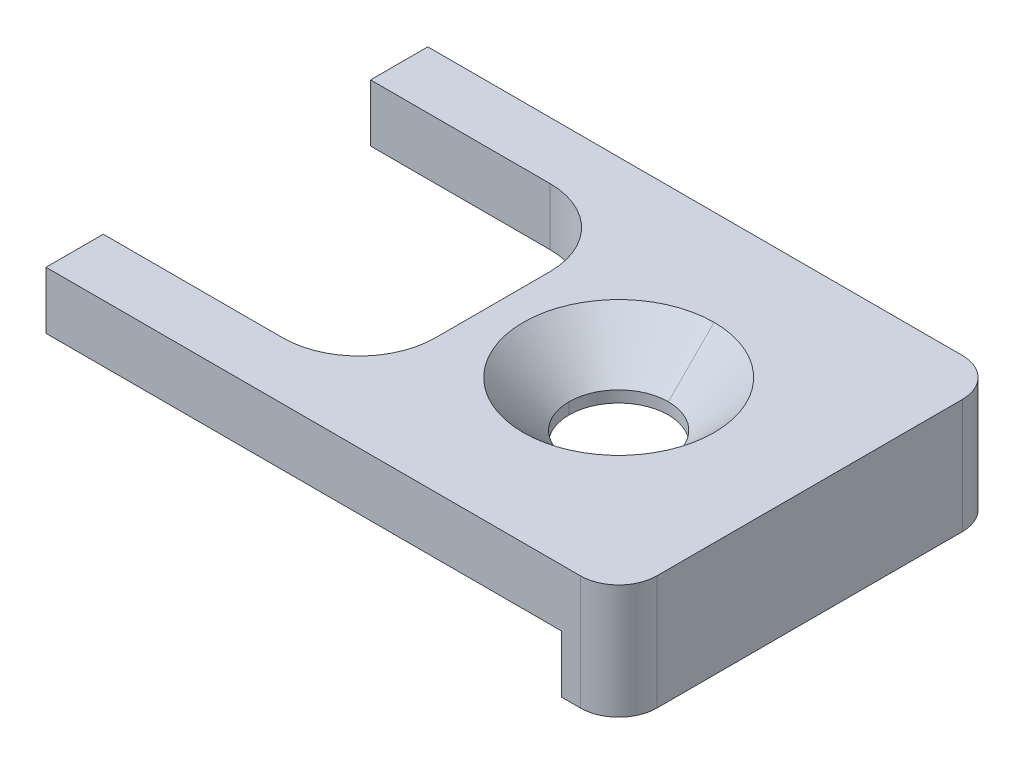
ISO-10303-21;
HEADER;
FILE_DESCRIPTION(('STEP AP214'),'2;1');
FILE_NAME('part.step','',(''),(''),'','','');
FILE_SCHEMA(('AUTOMOTIVE_DESIGN { 1 0 10303 214 1 1 1 1 }'));
ENDSEC;
DATA;
#1=APPLICATION_CONTEXT('core data for automotive mechanical design processes');
#2=APPLICATION_PROTOCOL_DEFINITION('international standard','automotive_design',2000,#1);
#3=PRODUCT_CONTEXT('',#1,'mechanical');
#4=PRODUCT('Part','Part','',(#3));
#5=PRODUCT_RELATED_PRODUCT_CATEGORY('part','',(#4));
#6=PRODUCT_DEFINITION_FORMATION('','',#4);
#7=PRODUCT_DEFINITION_CONTEXT('part definition',#1,'design');
#8=PRODUCT_DEFINITION('design','',#6,#7);
#9=PRODUCT_DEFINITION_SHAPE('','',#8);
#10=(LENGTH_UNIT() NAMED_UNIT(*) SI_UNIT(.MILLI.,.METRE.));
#11=(NAMED_UNIT(*) PLANE_ANGLE_UNIT() SI_UNIT($,.RADIAN.));
#12=(NAMED_UNIT(*) SI_UNIT($,.STERADIAN.) SOLID_ANGLE_UNIT());
#13=UNCERTAINTY_MEASURE_WITH_UNIT(LENGTH_MEASURE(1.E-05),#10,'distance_accuracy_value','');
#14=(GEOMETRIC_REPRESENTATION_CONTEXT(3) GLOBAL_UNCERTAINTY_ASSIGNED_CONTEXT((#13)) GLOBAL_UNIT_ASSIGNED_CONTEXT((#10,
#11,#12)) REPRESENTATION_CONTEXT('',''));
#15=CARTESIAN_POINT('',(0.,0.,0.));
#16=DIRECTION('',(0.,0.,1.));
#17=DIRECTION('',(1.,0.,0.));
#18=AXIS2_PLACEMENT_3D('',#15,#16,#17);
#19=CARTESIAN_POINT('',(14.,0.,9.));
#20=DIRECTION('',(0.,-1.,0.));
#21=DIRECTION('',(0.,0.,-1.));
#22=AXIS2_PLACEMENT_3D('',#19,#20,#21);
#23=CYLINDRICAL_SURFACE('',#22,1.);
#24=CARTESIAN_POINT('',(14.,0.,9.));
#25=DIRECTION('',(0.,-1.,0.));
#26=DIRECTION('',(-1.,0.,0.));
#27=AXIS2_PLACEMENT_3D('',#24,#25,#26);
#28=CIRCLE('',#27,1.);
#29=CARTESIAN_POINT('',(15.,0.,9.));
#30=VERTEX_POINT('',#29);
#31=CARTESIAN_POINT('',(14.,0.,10.));
#32=VERTEX_POINT('',#31);
#33=EDGE_CURVE('E217',#30,#32,#28,.T.);
#34=ORIENTED_EDGE('',*,*,#33,.F.);
#35=DIRECTION('',(0.,-1.,0.));
#36=VECTOR('',#35,1.);
#37=CARTESIAN_POINT('',(15.,0.,9.));
#38=LINE('',#37,#36);
#39=CARTESIAN_POINT('',(15.,3.,9.));
#40=VERTEX_POINT('',#39);
#41=EDGE_CURVE('E212',#40,#30,#38,.T.);
#42=ORIENTED_EDGE('',*,*,#41,.F.);
#43=CARTESIAN_POINT('',(14.,3.,9.));
#44=DIRECTION('',(0.,1.,0.));
#45=DIRECTION('',(1.,0.,0.));
#46=AXIS2_PLACEMENT_3D('',#43,#44,#45);
#47=CIRCLE('',#46,1.);
#48=CARTESIAN_POINT('',(14.,3.,10.));
#49=VERTEX_POINT('',#48);
#50=EDGE_CURVE('E127',#49,#40,#47,.T.);
#51=ORIENTED_EDGE('',*,*,#50,.F.);
#52=DIRECTION('',(0.,1.,0.));
#53=VECTOR('',#52,1.);
#54=CARTESIAN_POINT('',(14.,3.,10.));
#55=LINE('',#54,#53);
#56=EDGE_CURVE('E41',#32,#49,#55,.T.);
#57=ORIENTED_EDGE('',*,*,#56,.F.);
#58=EDGE_LOOP('',(#34,#42,#51,#57));
#59=FACE_BOUND('',#58,.T.);
#60=ADVANCED_FACE('F15',(#59),#23,.T.);
#61=CARTESIAN_POINT('',(14.,0.,1.));
#62=DIRECTION('',(0.,1.,0.));
#63=DIRECTION('',(0.,0.,1.));
#64=AXIS2_PLACEMENT_3D('',#61,#62,#63);
#65=CYLINDRICAL_SURFACE('',#64,1.);
#66=CARTESIAN_POINT('',(14.,0.,1.));
#67=DIRECTION('',(0.,-1.,0.));
#68=DIRECTION('',(-1.,0.,0.));
#69=AXIS2_PLACEMENT_3D('',#66,#67,#68);
#70=CIRCLE('',#69,1.);
#71=CARTESIAN_POINT('',(14.,0.,0.));
#72=VERTEX_POINT('',#71);
#73=CARTESIAN_POINT('',(15.,0.,1.));
#74=VERTEX_POINT('',#73);
#75=EDGE_CURVE('E201',#72,#74,#70,.T.);
#76=ORIENTED_EDGE('',*,*,#75,.F.);
#77=DIRECTION('',(0.,-1.,0.));
#78=VECTOR('',#77,1.);
#79=CARTESIAN_POINT('',(14.,0.,0.));
#80=LINE('',#79,#78);
#81=CARTESIAN_POINT('',(14.,3.,0.));
#82=VERTEX_POINT('',#81);
#83=EDGE_CURVE('E250',#82,#72,#80,.T.);
#84=ORIENTED_EDGE('',*,*,#83,.F.);
#85=CARTESIAN_POINT('',(14.,3.,1.));
#86=DIRECTION('',(0.,1.,0.));
#87=DIRECTION('',(1.,0.,0.));
#88=AXIS2_PLACEMENT_3D('',#85,#86,#87);
#89=CIRCLE('',#88,1.);
#90=CARTESIAN_POINT('',(15.,3.,1.));
#91=VERTEX_POINT('',#90);
#92=EDGE_CURVE('E115',#91,#82,#89,.T.);
#93=ORIENTED_EDGE('',*,*,#92,.F.);
#94=DIRECTION('',(0.,1.,0.));
#95=VECTOR('',#94,1.);
#96=CARTESIAN_POINT('',(15.,0.,1.));
#97=LINE('',#96,#95);
#98=EDGE_CURVE('E197',#74,#91,#97,.T.);
#99=ORIENTED_EDGE('',*,*,#98,.F.);
#100=EDGE_LOOP('',(#76,#84,#93,#99));
#101=FACE_BOUND('',#100,.T.);
#102=ADVANCED_FACE('F199',(#101),#65,.T.);
#103=CARTESIAN_POINT('',(10.,1.8,5.));
#104=DIRECTION('',(0.,1.,0.));
#105=DIRECTION('',(0.,0.,1.));
#106=AXIS2_PLACEMENT_3D('',#103,#104,#105);
#107=CONICAL_SURFACE('',#106,1.3,0.78539816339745);
#108=DIRECTION('',(0.,0.707106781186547,-0.707106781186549));
#109=VECTOR('',#108,1.);
#110=CARTESIAN_POINT('',(10.,1.8,3.7));
#111=LINE('',#110,#109);
#112=CARTESIAN_POINT('',(10.,1.8,3.7));
#113=VERTEX_POINT('',#112);
#114=CARTESIAN_POINT('',(10.,3.,2.5));
#115=VERTEX_POINT('',#114);
#116=EDGE_CURVE('E312',#113,#115,#111,.T.);
#117=ORIENTED_EDGE('',*,*,#116,.F.);
#118=CARTESIAN_POINT('',(10.,1.8,5.));
#119=DIRECTION('',(0.,1.,0.));
#120=DIRECTION('',(0.,0.,-1.));
#121=AXIS2_PLACEMENT_3D('',#118,#119,#120);
#122=CIRCLE('',#121,1.3);
#123=CARTESIAN_POINT('',(11.3,1.8,5.));
#124=VERTEX_POINT('',#123);
#125=EDGE_CURVE('E257',#124,#113,#122,.T.);
#126=ORIENTED_EDGE('',*,*,#125,.F.);
#127=CARTESIAN_POINT('',(10.,1.8,5.));
#128=DIRECTION('',(0.,1.,0.));
#129=DIRECTION('',(0.,0.,-1.));
#130=AXIS2_PLACEMENT_3D('',#127,#128,#129);
#131=CIRCLE('',#130,1.3);
#132=CARTESIAN_POINT('',(10.,1.8,6.3));
#133=VERTEX_POINT('',#132);
#134=EDGE_CURVE('E10',#133,#124,#131,.T.);
#135=ORIENTED_EDGE('',*,*,#134,.F.);
#136=DIRECTION('',(0.,0.707106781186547,0.707106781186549));
#137=VECTOR('',#136,1.);
#138=CARTESIAN_POINT('',(10.,1.8,6.3));
#139=LINE('',#138,#137);
#140=CARTESIAN_POINT('',(10.,3.,7.5));
#141=VERTEX_POINT('',#140);
#142=EDGE_CURVE('E259',#133,#141,#139,.T.);
#143=ORIENTED_EDGE('',*,*,#142,.T.);
#144=CARTESIAN_POINT('',(10.,3.,5.));
#145=DIRECTION('',(0.,-1.,0.));
#146=DIRECTION('',(1.,0.,0.));
#147=AXIS2_PLACEMENT_3D('',#144,#145,#146);
#148=CIRCLE('',#147,2.5);
#149=EDGE_CURVE('E304',#115,#141,#148,.T.);
#150=ORIENTED_EDGE('',*,*,#149,.F.);
#151=EDGE_LOOP('',(#117,#126,#135,#143,#150));
#152=FACE_BOUND('',#151,.T.);
#153=ADVANCED_FACE('F375',(#152),#107,.F.);
#154=CARTESIAN_POINT('',(10.,0.,5.));
#155=DIRECTION('',(0.,1.,0.));
#156=DIRECTION('',(-1.,0.,0.));
#157=AXIS2_PLACEMENT_3D('',#154,#155,#156);
#158=CYLINDRICAL_SURFACE('',#157,1.3);
#159=DIRECTION('',(0.,1.,0.));
#160=VECTOR('',#159,1.);
#161=CARTESIAN_POINT('',(11.3,0.,5.));
#162=LINE('',#161,#160);
#163=CARTESIAN_POINT('',(11.3,1.5,5.));
#164=VERTEX_POINT('',#163);
#165=EDGE_CURVE('E253',#164,#124,#162,.T.);
#166=ORIENTED_EDGE('',*,*,#165,.F.);
#167=CARTESIAN_POINT('',(10.,1.5,5.));
#168=DIRECTION('',(0.,1.,0.));
#169=DIRECTION('',(-1.,0.,0.));
#170=AXIS2_PLACEMENT_3D('',#167,#168,#169);
#171=CIRCLE('',#170,1.3);
#172=CARTESIAN_POINT('',(8.7,1.5,5.));
#173=VERTEX_POINT('',#172);
#174=EDGE_CURVE('E336',#173,#164,#171,.T.);
#175=ORIENTED_EDGE('',*,*,#174,.F.);
#176=DIRECTION('',(0.,1.,0.));
#177=VECTOR('',#176,1.);
#178=CARTESIAN_POINT('',(8.7,0.,5.));
#179=LINE('',#178,#177);
#180=CARTESIAN_POINT('',(8.7,1.8,5.));
#181=VERTEX_POINT('',#180);
#182=EDGE_CURVE('E789',#173,#181,#179,.T.);
#183=ORIENTED_EDGE('',*,*,#182,.T.);
#184=CARTESIAN_POINT('',(10.,1.8,5.));
#185=DIRECTION('',(0.,1.,0.));
#186=DIRECTION('',(0.,0.,-1.));
#187=AXIS2_PLACEMENT_3D('',#184,#185,#186);
#188=CIRCLE('',#187,1.3);
#189=EDGE_CURVE('E263',#181,#133,#188,.T.);
#190=ORIENTED_EDGE('',*,*,#189,.T.);
#191=ORIENTED_EDGE('',*,*,#134,.T.);
#192=EDGE_LOOP('',(#166,#175,#183,#190,#191));
#193=FACE_BOUND('',#192,.T.);
#194=ADVANCED_FACE('F385',(#193),#158,.F.);
#195=CARTESIAN_POINT('',(-1.46522777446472,0.,8.5));
#196=DIRECTION('',(0.,0.,1.));
#197=DIRECTION('',(1.,0.,0.));
#198=AXIS2_PLACEMENT_3D('',#195,#196,#197);
#199=PLANE('',#198);
#200=DIRECTION('',(-1.,0.,0.));
#201=VECTOR('',#200,1.);
#202=CARTESIAN_POINT('',(15.,3.,8.5));
#203=LINE('',#202,#201);
#204=CARTESIAN_POINT('',(4.7,3.,8.5));
#205=VERTEX_POINT('',#204);
#206=CARTESIAN_POINT('',(0.,3.,8.5));
#207=VERTEX_POINT('',#206);
#208=EDGE_CURVE('E276',#205,#207,#203,.T.);
#209=ORIENTED_EDGE('',*,*,#208,.F.);
#210=DIRECTION('',(0.,1.,0.));
#211=VECTOR('',#210,1.);
#212=CARTESIAN_POINT('',(4.7,0.,8.5));
#213=LINE('',#212,#211);
#214=CARTESIAN_POINT('',(4.7,1.5,8.5));
#215=VERTEX_POINT('',#214);
#216=EDGE_CURVE('E26',#215,#205,#213,.T.);
#217=ORIENTED_EDGE('',*,*,#216,.F.);
#218=DIRECTION('',(1.,0.,0.));
#219=VECTOR('',#218,1.);
#220=CARTESIAN_POINT('',(0.,1.5,8.5));
#221=LINE('',#220,#219);
#222=CARTESIAN_POINT('',(0.,1.5,8.5));
#223=VERTEX_POINT('',#222);
#224=EDGE_CURVE('E803',#223,#215,#221,.T.);
#225=ORIENTED_EDGE('',*,*,#224,.F.);
#226=DIRECTION('',(0.,-1.,0.));
#227=VECTOR('',#226,1.);
#228=CARTESIAN_POINT('',(0.,3.,8.5));
#229=LINE('',#228,#227);
#230=EDGE_CURVE('E327',#207,#223,#229,.T.);
#231=ORIENTED_EDGE('',*,*,#230,.F.);
#232=EDGE_LOOP('',(#209,#217,#225,#231));
#233=FACE_BOUND('',#232,.T.);
#234=ADVANCED_FACE('F378',(#233),#199,.F.);
#235=CARTESIAN_POINT('',(4.7,0.,6.5));
#236=DIRECTION('',(0.,1.,0.));
#237=DIRECTION('',(-1.,0.,0.));
#238=AXIS2_PLACEMENT_3D('',#235,#236,#237);
#239=CYLINDRICAL_SURFACE('',#238,2.);
#240=ORIENTED_EDGE('',*,*,#216,.T.);
#241=CARTESIAN_POINT('',(4.7,3.,6.5));
#242=DIRECTION('',(0.,1.,0.));
#243=DIRECTION('',(1.,0.,0.));
#244=AXIS2_PLACEMENT_3D('',#241,#242,#243);
#245=CIRCLE('',#244,2.);
#246=CARTESIAN_POINT('',(6.7,3.,6.5));
#247=VERTEX_POINT('',#246);
#248=EDGE_CURVE('E273',#205,#247,#245,.T.);
#249=ORIENTED_EDGE('',*,*,#248,.T.);
#250=DIRECTION('',(0.,1.,0.));
#251=VECTOR('',#250,1.);
#252=CARTESIAN_POINT('',(6.7,0.,6.5));
#253=LINE('',#252,#251);
#254=CARTESIAN_POINT('',(6.7,1.5,6.5));
#255=VERTEX_POINT('',#254);
#256=EDGE_CURVE('E331',#255,#247,#253,.T.);
#257=ORIENTED_EDGE('',*,*,#256,.F.);
#258=CARTESIAN_POINT('',(4.7,1.5,6.5));
#259=DIRECTION('',(0.,1.,0.));
#260=DIRECTION('',(-1.,0.,0.));
#261=AXIS2_PLACEMENT_3D('',#258,#259,#260);
#262=CIRCLE('',#261,2.);
#263=EDGE_CURVE('E337',#215,#255,#262,.T.);
#264=ORIENTED_EDGE('',*,*,#263,.F.);
#265=EDGE_LOOP('',(#240,#249,#257,#264));
#266=FACE_BOUND('',#265,.T.);
#267=ADVANCED_FACE('F600',(#266),#239,.F.);
#268=CARTESIAN_POINT('',(6.7,0.,3.5));
#269=DIRECTION('',(1.,0.,0.));
#270=DIRECTION('',(0.,1.,0.));
#271=AXIS2_PLACEMENT_3D('',#268,#269,#270);
#272=PLANE('',#271);
#273=ORIENTED_EDGE('',*,*,#256,.T.);
#274=DIRECTION('',(0.,0.,-1.));
#275=VECTOR('',#274,1.);
#276=CARTESIAN_POINT('',(6.7,3.,3.5));
#277=LINE('',#276,#275);
#278=CARTESIAN_POINT('',(6.7,3.,3.5));
#279=VERTEX_POINT('',#278);
#280=EDGE_CURVE('E277',#247,#279,#277,.T.);
#281=ORIENTED_EDGE('',*,*,#280,.T.);
#282=DIRECTION('',(0.,1.,0.));
#283=VECTOR('',#282,1.);
#284=CARTESIAN_POINT('',(6.7,0.,3.5));
#285=LINE('',#284,#283);
#286=CARTESIAN_POINT('',(6.7,1.5,3.5));
#287=VERTEX_POINT('',#286);
#288=EDGE_CURVE('E249',#287,#279,#285,.T.);
#289=ORIENTED_EDGE('',*,*,#288,.F.);
#290=DIRECTION('',(0.,0.,-1.));
#291=VECTOR('',#290,1.);
#292=CARTESIAN_POINT('',(6.7,1.5,10.));
#293=LINE('',#292,#291);
#294=EDGE_CURVE('E332',#255,#287,#293,.T.);
#295=ORIENTED_EDGE('',*,*,#294,.F.);
#296=EDGE_LOOP('',(#273,#281,#289,#295));
#297=FACE_BOUND('',#296,.T.);
#298=ADVANCED_FACE('F642',(#297),#272,.F.);
#299=CARTESIAN_POINT('',(4.7,0.,3.5));
#300=DIRECTION('',(0.,1.,0.));
#301=DIRECTION('',(-1.,0.,0.));
#302=AXIS2_PLACEMENT_3D('',#299,#300,#301);
#303=CYLINDRICAL_SURFACE('',#302,2.);
#304=ORIENTED_EDGE('',*,*,#288,.T.);
#305=CARTESIAN_POINT('',(4.7,3.,3.5));
#306=DIRECTION('',(0.,1.,0.));
#307=DIRECTION('',(-1.,0.,0.));
#308=AXIS2_PLACEMENT_3D('',#305,#306,#307);
#309=CIRCLE('',#308,2.);
#310=CARTESIAN_POINT('',(4.7,3.,1.5));
#311=VERTEX_POINT('',#310);
#312=EDGE_CURVE('E289',#279,#311,#309,.T.);
#313=ORIENTED_EDGE('',*,*,#312,.T.);
#314=DIRECTION('',(0.,1.,0.));
#315=VECTOR('',#314,1.);
#316=CARTESIAN_POINT('',(4.7,0.,1.5));
#317=LINE('',#316,#315);
#318=CARTESIAN_POINT('',(4.7,1.5,1.5));
#319=VERTEX_POINT('',#318);
#320=EDGE_CURVE('E245',#319,#311,#317,.T.);
#321=ORIENTED_EDGE('',*,*,#320,.F.);
#322=CARTESIAN_POINT('',(4.7,1.5,3.5));
#323=DIRECTION('',(0.,1.,0.));
#324=DIRECTION('',(-1.,0.,0.));
#325=AXIS2_PLACEMENT_3D('',#322,#323,#324);
#326=CIRCLE('',#325,2.);
#327=EDGE_CURVE('E230',#287,#319,#326,.T.);
#328=ORIENTED_EDGE('',*,*,#327,.F.);
#329=EDGE_LOOP('',(#304,#313,#321,#328));
#330=FACE_BOUND('',#329,.T.);
#331=ADVANCED_FACE('F391',(#330),#303,.F.);
#332=CARTESIAN_POINT('',(-1.46522777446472,0.,1.5));
#333=DIRECTION('',(0.,0.,-1.));
#334=DIRECTION('',(0.,-1.,0.));
#335=AXIS2_PLACEMENT_3D('',#332,#333,#334);
#336=PLANE('',#335);
#337=DIRECTION('',(-1.,0.,0.));
#338=VECTOR('',#337,1.);
#339=CARTESIAN_POINT('',(0.,1.5,1.5));
#340=LINE('',#339,#338);
#341=CARTESIAN_POINT('',(0.,1.5,1.5));
#342=VERTEX_POINT('',#341);
#343=EDGE_CURVE('E233',#319,#342,#340,.T.);
#344=ORIENTED_EDGE('',*,*,#343,.F.);
#345=ORIENTED_EDGE('',*,*,#320,.T.);
#346=DIRECTION('',(-1.,0.,0.));
#347=VECTOR('',#346,1.);
#348=CARTESIAN_POINT('',(-1.46522777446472,3.,1.5));
#349=LINE('',#348,#347);
#350=CARTESIAN_POINT('',(0.,3.,1.5));
#351=VERTEX_POINT('',#350);
#352=EDGE_CURVE('E238',#311,#351,#349,.T.);
#353=ORIENTED_EDGE('',*,*,#352,.T.);
#354=DIRECTION('',(0.,1.,0.));
#355=VECTOR('',#354,1.);
#356=CARTESIAN_POINT('',(0.,3.,1.5));
#357=LINE('',#356,#355);
#358=EDGE_CURVE('E268',#342,#351,#357,.T.);
#359=ORIENTED_EDGE('',*,*,#358,.F.);
#360=EDGE_LOOP('',(#344,#345,#353,#359));
#361=FACE_BOUND('',#360,.T.);
#362=ADVANCED_FACE('F383',(#361),#336,.F.);
#363=CARTESIAN_POINT('',(0.,0.,0.));
#364=DIRECTION('',(0.,0.,1.));
#365=DIRECTION('',(1.,0.,0.));
#366=AXIS2_PLACEMENT_3D('',#363,#364,#365);
#367=PLANE('',#366);
#368=DIRECTION('',(-1.,0.,0.));
#369=VECTOR('',#368,1.);
#370=CARTESIAN_POINT('',(15.,3.,0.));
#371=LINE('',#370,#369);
#372=CARTESIAN_POINT('',(0.,3.,0.));
#373=VERTEX_POINT('',#372);
#374=EDGE_CURVE('E235',#82,#373,#371,.T.);
#375=ORIENTED_EDGE('',*,*,#374,.F.);
#376=ORIENTED_EDGE('',*,*,#83,.T.);
#377=DIRECTION('',(1.,0.,0.));
#378=VECTOR('',#377,1.);
#379=CARTESIAN_POINT('',(13.5,0.,0.));
#380=LINE('',#379,#378);
#381=CARTESIAN_POINT('',(13.5,0.,0.));
#382=VERTEX_POINT('',#381);
#383=EDGE_CURVE('E220',#382,#72,#380,.T.);
#384=ORIENTED_EDGE('',*,*,#383,.F.);
#385=DIRECTION('',(0.,-1.,0.));
#386=VECTOR('',#385,1.);
#387=CARTESIAN_POINT('',(13.5,1.5,0.));
#388=LINE('',#387,#386);
#389=CARTESIAN_POINT('',(13.5,1.5,0.));
#390=VERTEX_POINT('',#389);
#391=EDGE_CURVE('E162',#390,#382,#388,.T.);
#392=ORIENTED_EDGE('',*,*,#391,.F.);
#393=DIRECTION('',(1.,0.,0.));
#394=VECTOR('',#393,1.);
#395=CARTESIAN_POINT('',(0.,1.5,0.));
#396=LINE('',#395,#394);
#397=CARTESIAN_POINT('',(0.,1.5,0.));
#398=VERTEX_POINT('',#397);
#399=EDGE_CURVE('E269',#398,#390,#396,.T.);
#400=ORIENTED_EDGE('',*,*,#399,.F.);
#401=DIRECTION('',(0.,-1.,0.));
#402=VECTOR('',#401,1.);
#403=CARTESIAN_POINT('',(0.,3.,0.));
#404=LINE('',#403,#402);
#405=EDGE_CURVE('E239',#373,#398,#404,.T.);
#406=ORIENTED_EDGE('',*,*,#405,.F.);
#407=EDGE_LOOP('',(#375,#376,#384,#392,#400,#406));
#408=FACE_BOUND('',#407,.T.);
#409=ADVANCED_FACE('F380',(#408),#367,.F.);
#410=CARTESIAN_POINT('',(0.,0.,10.));
#411=DIRECTION('',(0.,0.,1.));
#412=DIRECTION('',(1.,0.,0.));
#413=AXIS2_PLACEMENT_3D('',#410,#411,#412);
#414=PLANE('',#413);
#415=DIRECTION('',(1.,0.,0.));
#416=VECTOR('',#415,1.);
#417=CARTESIAN_POINT('',(13.5,0.,10.));
#418=LINE('',#417,#416);
#419=CARTESIAN_POINT('',(13.5,0.,10.));
#420=VERTEX_POINT('',#419);
#421=EDGE_CURVE('E207',#420,#32,#418,.T.);
#422=ORIENTED_EDGE('',*,*,#421,.T.);
#423=ORIENTED_EDGE('',*,*,#56,.T.);
#424=DIRECTION('',(-1.,0.,0.));
#425=VECTOR('',#424,1.);
#426=CARTESIAN_POINT('',(15.,3.,10.));
#427=LINE('',#426,#425);
#428=CARTESIAN_POINT('',(0.,3.,10.));
#429=VERTEX_POINT('',#428);
#430=EDGE_CURVE('E285',#49,#429,#427,.T.);
#431=ORIENTED_EDGE('',*,*,#430,.T.);
#432=DIRECTION('',(0.,-1.,0.));
#433=VECTOR('',#432,1.);
#434=CARTESIAN_POINT('',(0.,3.,10.));
#435=LINE('',#434,#433);
#436=CARTESIAN_POINT('',(0.,1.5,10.));
#437=VERTEX_POINT('',#436);
#438=EDGE_CURVE('E234',#429,#437,#435,.T.);
#439=ORIENTED_EDGE('',*,*,#438,.T.);
#440=DIRECTION('',(1.,0.,0.));
#441=VECTOR('',#440,1.);
#442=CARTESIAN_POINT('',(0.,1.5,10.));
#443=LINE('',#442,#441);
#444=CARTESIAN_POINT('',(13.5,1.5,10.));
#445=VERTEX_POINT('',#444);
#446=EDGE_CURVE('E807',#437,#445,#443,.T.);
#447=ORIENTED_EDGE('',*,*,#446,.T.);
#448=DIRECTION('',(0.,-1.,0.));
#449=VECTOR('',#448,1.);
#450=CARTESIAN_POINT('',(13.5,1.5,10.));
#451=LINE('',#450,#449);
#452=EDGE_CURVE('E174',#445,#420,#451,.T.);
#453=ORIENTED_EDGE('',*,*,#452,.T.);
#454=EDGE_LOOP('',(#422,#423,#431,#439,#447,#453));
#455=FACE_BOUND('',#454,.T.);
#456=ADVANCED_FACE('F382',(#455),#414,.T.);
#457=CARTESIAN_POINT('',(15.,3.,10.));
#458=DIRECTION('',(0.,-1.,0.));
#459=DIRECTION('',(0.,0.,-1.));
#460=AXIS2_PLACEMENT_3D('',#457,#458,#459);
#461=PLANE('',#460);
#462=CARTESIAN_POINT('',(10.,3.,5.));
#463=DIRECTION('',(0.,-1.,0.));
#464=DIRECTION('',(1.,0.,0.));
#465=AXIS2_PLACEMENT_3D('',#462,#463,#464);
#466=CIRCLE('',#465,2.5);
#467=EDGE_CURVE('E264',#141,#115,#466,.T.);
#468=ORIENTED_EDGE('',*,*,#467,.T.);
#469=ORIENTED_EDGE('',*,*,#149,.T.);
#470=EDGE_LOOP('',(#468,#469));
#471=FACE_BOUND('',#470,.T.);
#472=DIRECTION('',(0.,0.,-1.));
#473=VECTOR('',#472,1.);
#474=CARTESIAN_POINT('',(15.,3.,10.));
#475=LINE('',#474,#473);
#476=EDGE_CURVE('E206',#40,#91,#475,.T.);
#477=ORIENTED_EDGE('',*,*,#476,.T.);
#478=ORIENTED_EDGE('',*,*,#92,.T.);
#479=ORIENTED_EDGE('',*,*,#374,.T.);
#480=DIRECTION('',(0.,0.,-1.));
#481=VECTOR('',#480,1.);
#482=CARTESIAN_POINT('',(0.,3.,10.));
#483=LINE('',#482,#481);
#484=EDGE_CURVE('E244',#351,#373,#483,.T.);
#485=ORIENTED_EDGE('',*,*,#484,.F.);
#486=ORIENTED_EDGE('',*,*,#352,.F.);
#487=ORIENTED_EDGE('',*,*,#312,.F.);
#488=ORIENTED_EDGE('',*,*,#280,.F.);
#489=ORIENTED_EDGE('',*,*,#248,.F.);
#490=ORIENTED_EDGE('',*,*,#208,.T.);
#491=DIRECTION('',(0.,0.,-1.));
#492=VECTOR('',#491,1.);
#493=CARTESIAN_POINT('',(0.,3.,10.));
#494=LINE('',#493,#492);
#495=EDGE_CURVE('E243',#429,#207,#494,.T.);
#496=ORIENTED_EDGE('',*,*,#495,.F.);
#497=ORIENTED_EDGE('',*,*,#430,.F.);
#498=ORIENTED_EDGE('',*,*,#50,.T.);
#499=EDGE_LOOP('',(#477,#478,#479,#485,#486,#487,#488,#489,#490,#496,#497,#498));
#500=FACE_BOUND('',#499,.T.);
#501=ADVANCED_FACE('F394',(#471,#500),#461,.F.);
#502=CARTESIAN_POINT('',(15.,0.,10.));
#503=DIRECTION('',(-1.,0.,0.));
#504=DIRECTION('',(0.,0.,1.));
#505=AXIS2_PLACEMENT_3D('',#502,#503,#504);
#506=PLANE('',#505);
#507=DIRECTION('',(0.,0.,-1.));
#508=VECTOR('',#507,1.);
#509=CARTESIAN_POINT('',(15.,0.,10.));
#510=LINE('',#509,#508);
#511=EDGE_CURVE('E210',#30,#74,#510,.T.);
#512=ORIENTED_EDGE('',*,*,#511,.T.);
#513=ORIENTED_EDGE('',*,*,#98,.T.);
#514=ORIENTED_EDGE('',*,*,#476,.F.);
#515=ORIENTED_EDGE('',*,*,#41,.T.);
#516=EDGE_LOOP('',(#512,#513,#514,#515));
#517=FACE_BOUND('',#516,.T.);
#518=ADVANCED_FACE('F211',(#517),#506,.F.);
#519=CARTESIAN_POINT('',(13.5,0.,10.));
#520=DIRECTION('',(0.,1.,0.));
#521=DIRECTION('',(1.,0.,0.));
#522=AXIS2_PLACEMENT_3D('',#519,#520,#521);
#523=PLANE('',#522);
#524=ORIENTED_EDGE('',*,*,#383,.T.);
#525=ORIENTED_EDGE('',*,*,#75,.T.);
#526=ORIENTED_EDGE('',*,*,#511,.F.);
#527=ORIENTED_EDGE('',*,*,#33,.T.);
#528=ORIENTED_EDGE('',*,*,#421,.F.);
#529=DIRECTION('',(0.,0.,-1.));
#530=VECTOR('',#529,1.);
#531=CARTESIAN_POINT('',(13.5,0.,10.));
#532=LINE('',#531,#530);
#533=EDGE_CURVE('E19',#420,#382,#532,.T.);
#534=ORIENTED_EDGE('',*,*,#533,.T.);
#535=EDGE_LOOP('',(#524,#525,#526,#527,#528,#534));
#536=FACE_BOUND('',#535,.T.);
#537=ADVANCED_FACE('F17',(#536),#523,.F.);
#538=CARTESIAN_POINT('',(13.5,1.5,10.));
#539=DIRECTION('',(1.,0.,0.));
#540=DIRECTION('',(0.,-1.,0.));
#541=AXIS2_PLACEMENT_3D('',#538,#539,#540);
#542=PLANE('',#541);
#543=ORIENTED_EDGE('',*,*,#391,.T.);
#544=ORIENTED_EDGE('',*,*,#533,.F.);
#545=ORIENTED_EDGE('',*,*,#452,.F.);
#546=DIRECTION('',(0.,0.,-1.));
#547=VECTOR('',#546,1.);
#548=CARTESIAN_POINT('',(13.5,1.5,10.));
#549=LINE('',#548,#547);
#550=EDGE_CURVE('E272',#445,#390,#549,.T.);
#551=ORIENTED_EDGE('',*,*,#550,.T.);
#552=EDGE_LOOP('',(#543,#544,#545,#551));
#553=FACE_BOUND('',#552,.T.);
#554=ADVANCED_FACE('F355',(#553),#542,.F.);
#555=CARTESIAN_POINT('',(0.,1.5,10.));
#556=DIRECTION('',(0.,1.,0.));
#557=DIRECTION('',(1.,0.,0.));
#558=AXIS2_PLACEMENT_3D('',#555,#556,#557);
#559=PLANE('',#558);
#560=ORIENTED_EDGE('',*,*,#174,.T.);
#561=CARTESIAN_POINT('',(10.,1.5,5.));
#562=DIRECTION('',(0.,1.,0.));
#563=DIRECTION('',(-1.,0.,0.));
#564=AXIS2_PLACEMENT_3D('',#561,#562,#563);
#565=CIRCLE('',#564,1.3);
#566=EDGE_CURVE('E258',#164,#173,#565,.T.);
#567=ORIENTED_EDGE('',*,*,#566,.T.);
#568=EDGE_LOOP('',(#560,#567));
#569=FACE_BOUND('',#568,.T.);
#570=ORIENTED_EDGE('',*,*,#327,.T.);
#571=ORIENTED_EDGE('',*,*,#343,.T.);
#572=DIRECTION('',(0.,0.,-1.));
#573=VECTOR('',#572,1.);
#574=CARTESIAN_POINT('',(0.,1.5,10.));
#575=LINE('',#574,#573);
#576=EDGE_CURVE('E345',#342,#398,#575,.T.);
#577=ORIENTED_EDGE('',*,*,#576,.T.);
#578=ORIENTED_EDGE('',*,*,#399,.T.);
#579=ORIENTED_EDGE('',*,*,#550,.F.);
#580=ORIENTED_EDGE('',*,*,#446,.F.);
#581=DIRECTION('',(0.,0.,-1.));
#582=VECTOR('',#581,1.);
#583=CARTESIAN_POINT('',(0.,1.5,10.));
#584=LINE('',#583,#582);
#585=EDGE_CURVE('E324',#437,#223,#584,.T.);
#586=ORIENTED_EDGE('',*,*,#585,.T.);
#587=ORIENTED_EDGE('',*,*,#224,.T.);
#588=ORIENTED_EDGE('',*,*,#263,.T.);
#589=ORIENTED_EDGE('',*,*,#294,.T.);
#590=EDGE_LOOP('',(#570,#571,#577,#578,#579,#580,#586,#587,#588,#589));
#591=FACE_BOUND('',#590,.T.);
#592=ADVANCED_FACE('F357',(#569,#591),#559,.F.);
#593=CARTESIAN_POINT('',(0.,3.,10.));
#594=DIRECTION('',(1.,0.,0.));
#595=DIRECTION('',(0.,-1.,0.));
#596=AXIS2_PLACEMENT_3D('',#593,#594,#595);
#597=PLANE('',#596);
#598=ORIENTED_EDGE('',*,*,#495,.T.);
#599=ORIENTED_EDGE('',*,*,#230,.T.);
#600=ORIENTED_EDGE('',*,*,#585,.F.);
#601=ORIENTED_EDGE('',*,*,#438,.F.);
#602=EDGE_LOOP('',(#598,#599,#600,#601));
#603=FACE_BOUND('',#602,.T.);
#604=ADVANCED_FACE('F364',(#603),#597,.F.);
#605=CARTESIAN_POINT('',(0.,3.,10.));
#606=DIRECTION('',(1.,0.,0.));
#607=DIRECTION('',(0.,-1.,0.));
#608=AXIS2_PLACEMENT_3D('',#605,#606,#607);
#609=PLANE('',#608);
#610=ORIENTED_EDGE('',*,*,#576,.F.);
#611=ORIENTED_EDGE('',*,*,#358,.T.);
#612=ORIENTED_EDGE('',*,*,#484,.T.);
#613=ORIENTED_EDGE('',*,*,#405,.T.);
#614=EDGE_LOOP('',(#610,#611,#612,#613));
#615=FACE_BOUND('',#614,.T.);
#616=ADVANCED_FACE('F410',(#615),#609,.F.);
#617=CARTESIAN_POINT('',(10.,0.,5.));
#618=DIRECTION('',(0.,1.,0.));
#619=DIRECTION('',(-1.,0.,0.));
#620=AXIS2_PLACEMENT_3D('',#617,#618,#619);
#621=CYLINDRICAL_SURFACE('',#620,1.3);
#622=ORIENTED_EDGE('',*,*,#566,.F.);
#623=ORIENTED_EDGE('',*,*,#165,.T.);
#624=ORIENTED_EDGE('',*,*,#125,.T.);
#625=CARTESIAN_POINT('',(10.,1.8,5.));
#626=DIRECTION('',(0.,1.,0.));
#627=DIRECTION('',(0.,0.,-1.));
#628=AXIS2_PLACEMENT_3D('',#625,#626,#627);
#629=CIRCLE('',#628,1.3);
#630=EDGE_CURVE('E320',#113,#181,#629,.T.);
#631=ORIENTED_EDGE('',*,*,#630,.T.);
#632=ORIENTED_EDGE('',*,*,#182,.F.);
#633=EDGE_LOOP('',(#622,#623,#624,#631,#632));
#634=FACE_BOUND('',#633,.T.);
#635=ADVANCED_FACE('F605',(#634),#621,.F.);
#636=CARTESIAN_POINT('',(10.,1.8,5.));
#637=DIRECTION('',(0.,1.,0.));
#638=DIRECTION('',(0.,0.,1.));
#639=AXIS2_PLACEMENT_3D('',#636,#637,#638);
#640=CONICAL_SURFACE('',#639,1.3,0.78539816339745);
#641=ORIENTED_EDGE('',*,*,#630,.F.);
#642=ORIENTED_EDGE('',*,*,#116,.T.);
#643=ORIENTED_EDGE('',*,*,#467,.F.);
#644=ORIENTED_EDGE('',*,*,#142,.F.);
#645=ORIENTED_EDGE('',*,*,#189,.F.);
#646=EDGE_LOOP('',(#641,#642,#643,#644,#645));
#647=FACE_BOUND('',#646,.T.);
#648=ADVANCED_FACE('F609',(#647),#640,.F.);
#649=CLOSED_SHELL('',(#60,#102,#153,#194,#234,#267,#298,#331,#362,#409,#456,#501,#518,#537,#554,
#592,#604,#616,#635,#648));
#650=MANIFOLD_SOLID_BREP('B1',#649);
#651=ADVANCED_BREP_SHAPE_REPRESENTATION('',(#18,#650),#14);
#652=SHAPE_DEFINITION_REPRESENTATION(#9,#651);
ENDSEC;
END-ISO-10303-21;
